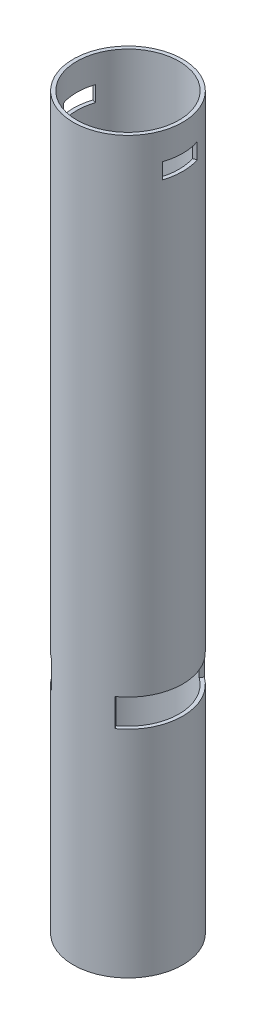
from build123d import *

# Parameters (mm, degrees)
ESQUISSE1_R                                    = 157.5
ESQUISSE1_R_2                                  = 146.9
BOSS_EXTRU_1_DEPTH                             = 2100
ESQUISSE2_W                                    = 127.5
ESQUISSE2_H                                    = 80
ENL_VEMENT_DE_MATI_RE_R_VOLUTION18_ANGLE       = 54.565
ENL_VEMENT_DE_MATI_RE_R_VOLUTION18_OTHER_ANGLE = 54.565
ENL_VEMENT_DE_MATI_RE_R_VOLUTION26_ANGLE       = 18.19
ENL_VEMENT_DE_MATI_RE_R_VOLUTION26_OTHER_ANGLE = 18.19


with BuildPart() as part:
    # Esquisse1 → Boss.-Extru.1 (new body)
    with BuildSketch(Plane(origin=(0, 0, 0), x_dir=(1, 0, 0), z_dir=(0, 1, 0))):
        with Locations(Location((0, 0, 0), (0, 0, 270))):
            Circle(ESQUISSE1_R)
        with Locations(Location((0, 0, 0), (0, 0, 270))):
            Circle(ESQUISSE1_R_2, mode=Mode.SUBTRACT)
    extrude(amount=BOSS_EXTRU_1_DEPTH)

    # Esquisse2 → Enl_vement de mati_re-R_volution18 (revolve, cut)
    with BuildSketch(Plane.XY):
        with Locations((93.75, 660)):
            Rectangle(ESQUISSE2_W, ESQUISSE2_H)
        with Locations((-93.75, 660)):
            Rectangle(ESQUISSE2_W, ESQUISSE2_H)
    revolve(axis=Axis((0, 700, 0), (0, -1, 0)), revolution_arc=ENL_VEMENT_DE_MATI_RE_R_VOLUTION18_ANGLE, mode=Mode.SUBTRACT)

    # Esquisse2 → Enl_vement de mati_re-R_volution18 other (revolve, cut)
    with BuildSketch(Plane.XY):
        with Locations((93.75, 660)):
            Rectangle(ESQUISSE2_W, ESQUISSE2_H)
        with Locations((-93.75, 660)):
            Rectangle(ESQUISSE2_W, ESQUISSE2_H)
    revolve(axis=Axis((0, 700, 0), (0, 1, 0)), revolution_arc=ENL_VEMENT_DE_MATI_RE_R_VOLUTION18_OTHER_ANGLE, mode=Mode.SUBTRACT)

    # Esquisse3 → Enl_vement de mati_re-R_volution26 (revolve, cut)
    with BuildSketch(Plane.XY):
        with BuildLine():
            Line((-157.5, 2022.5), (-15.956476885, 2022.5))
            Line((-15.956476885, 2022.5), (-15.956476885, 1977.5))
            Line((-15.956476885, 1977.5), (-157.5, 1977.5))
            ThreePointArc((-157.5, 1977.5), (-182.601893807, 2000), (-157.5, 2022.5))
        make_face()
        with BuildLine():
            Line((14.043523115, 2022.5), (14.043523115, 1977.5))
            Line((14.043523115, 1977.5), (157.5, 1977.5))
            ThreePointArc((157.5, 1977.5), (162.83868357, 2000), (157.5, 2022.5))
            Line((157.5, 2022.5), (14.043523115, 2022.5))
        make_face()
    revolve(axis=Axis((-0.956476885, 2022.5, 0), (0, -1, 0)), revolution_arc=ENL_VEMENT_DE_MATI_RE_R_VOLUTION26_ANGLE, mode=Mode.SUBTRACT)

    # Esquisse3 → Enl_vement de mati_re-R_volution26 other (revolve, cut)
    with BuildSketch(Plane.XY):
        with BuildLine():
            Line((-157.5, 2022.5), (-15.956476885, 2022.5))
            Line((-15.956476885, 2022.5), (-15.956476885, 1977.5))
            Line((-15.956476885, 1977.5), (-157.5, 1977.5))
            ThreePointArc((-157.5, 1977.5), (-182.601893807, 2000), (-157.5, 2022.5))
        make_face()
        with BuildLine():
            Line((14.043523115, 2022.5), (14.043523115, 1977.5))
            Line((14.043523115, 1977.5), (157.5, 1977.5))
            ThreePointArc((157.5, 1977.5), (162.83868357, 2000), (157.5, 2022.5))
            Line((157.5, 2022.5), (14.043523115, 2022.5))
        make_face()
    revolve(axis=Axis((-0.956476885, 2022.5, 0), (0, 1, 0)), revolution_arc=ENL_VEMENT_DE_MATI_RE_R_VOLUTION26_OTHER_ANGLE, mode=Mode.SUBTRACT)


solid = part.part
